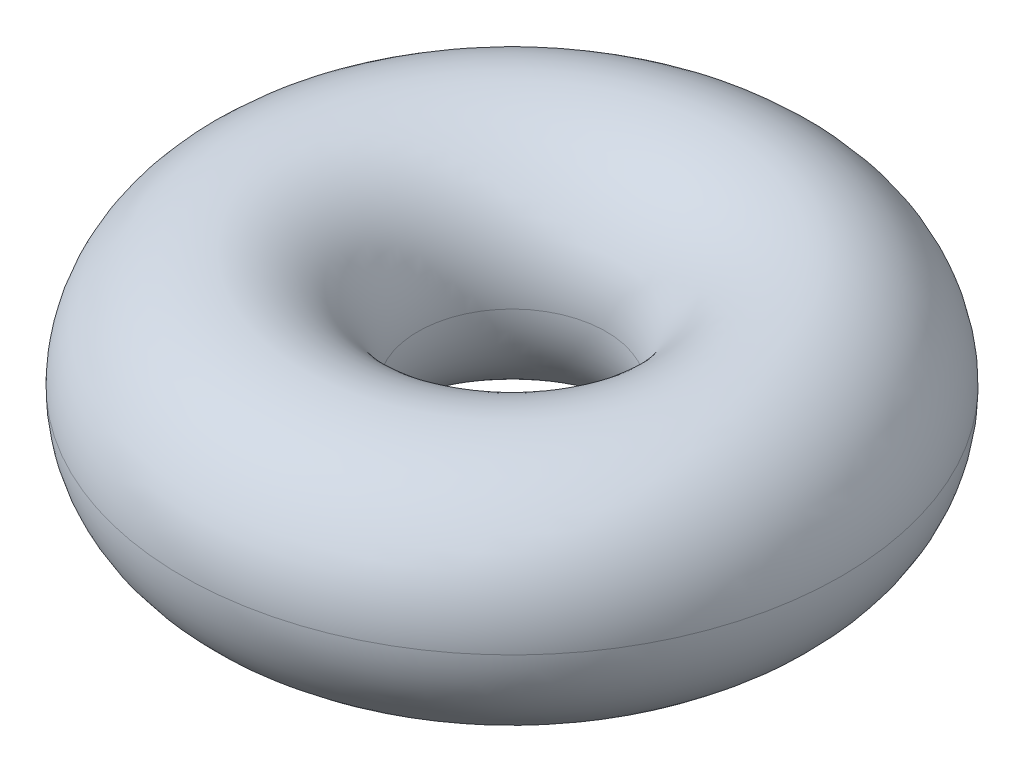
from build123d import *

# Parameters (mm, degrees)
SKETCH1_R = 12.5


with BuildPart() as part:
    # Sketch1 → Revolve1 (revolve)
    with BuildSketch(Plane.XY, mode=Mode.PRIVATE) as revolve1_sk:
        with Locations((22.5, 0)):
            Circle(SKETCH1_R)
    revolve(revolve1_sk.sketch.rotate(Axis((0, 0, 0), (0, 1, 0)), 90), axis=Axis((0, 0, 0), (0, 1, 0)))


solid = part.part
